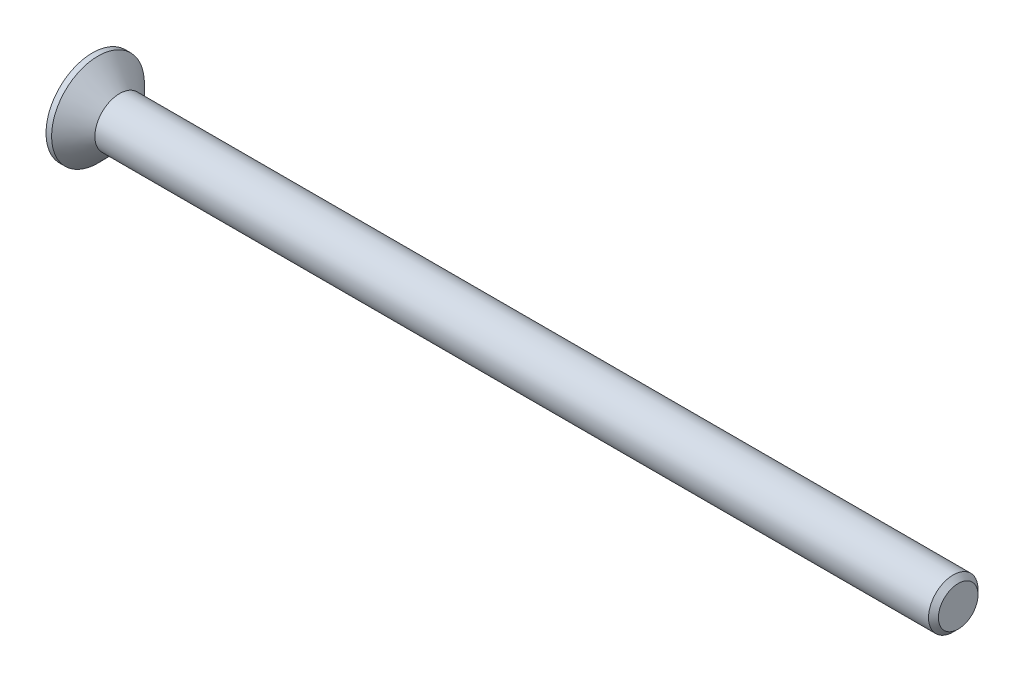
ISO-10303-21;
HEADER;
FILE_DESCRIPTION(('STEP AP214'),'2;1');
FILE_NAME('part.step','',(''),(''),'','','');
FILE_SCHEMA(('AUTOMOTIVE_DESIGN { 1 0 10303 214 1 1 1 1 }'));
ENDSEC;
DATA;
#1=APPLICATION_CONTEXT('core data for automotive mechanical design processes');
#2=APPLICATION_PROTOCOL_DEFINITION('international standard','automotive_design',2000,#1);
#3=PRODUCT_CONTEXT('',#1,'mechanical');
#4=PRODUCT('Part','Part','',(#3));
#5=PRODUCT_RELATED_PRODUCT_CATEGORY('part','',(#4));
#6=PRODUCT_DEFINITION_FORMATION('','',#4);
#7=PRODUCT_DEFINITION_CONTEXT('part definition',#1,'design');
#8=PRODUCT_DEFINITION('design','',#6,#7);
#9=PRODUCT_DEFINITION_SHAPE('','',#8);
#10=(LENGTH_UNIT() NAMED_UNIT(*) SI_UNIT(.MILLI.,.METRE.));
#11=(NAMED_UNIT(*) PLANE_ANGLE_UNIT() SI_UNIT($,.RADIAN.));
#12=(NAMED_UNIT(*) SI_UNIT($,.STERADIAN.) SOLID_ANGLE_UNIT());
#13=UNCERTAINTY_MEASURE_WITH_UNIT(LENGTH_MEASURE(1.E-05),#10,'distance_accuracy_value','');
#14=(GEOMETRIC_REPRESENTATION_CONTEXT(3) GLOBAL_UNCERTAINTY_ASSIGNED_CONTEXT((#13)) GLOBAL_UNIT_ASSIGNED_CONTEXT((#10,
#11,#12)) REPRESENTATION_CONTEXT('',''));
#15=CARTESIAN_POINT('',(0.,0.,0.));
#16=DIRECTION('',(0.,0.,1.));
#17=DIRECTION('',(1.,0.,0.));
#18=AXIS2_PLACEMENT_3D('',#15,#16,#17);
#19=CARTESIAN_POINT('',(0.,0.,0.));
#20=DIRECTION('',(-1.,0.,0.));
#21=DIRECTION('',(0.,0.,1.));
#22=AXIS2_PLACEMENT_3D('',#19,#20,#21);
#23=CONICAL_SURFACE('',#22,2.,0.78539816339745);
#24=CARTESIAN_POINT('',(-1.74999999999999,0.,0.));
#25=DIRECTION('',(-1.,0.,0.));
#26=DIRECTION('',(0.,0.,1.));
#27=AXIS2_PLACEMENT_3D('',#24,#25,#26);
#28=CIRCLE('',#27,3.75);
#29=CARTESIAN_POINT('',(-1.74999999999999,0.,3.75));
#30=VERTEX_POINT('',#29);
#31=EDGE_CURVE('E189',#30,#30,#28,.T.);
#32=ORIENTED_EDGE('',*,*,#31,.F.);
#33=EDGE_LOOP('',(#32));
#34=FACE_BOUND('',#33,.T.);
#35=CARTESIAN_POINT('',(0.,0.,0.));
#36=DIRECTION('',(-1.,0.,0.));
#37=DIRECTION('',(0.,0.,1.));
#38=AXIS2_PLACEMENT_3D('',#35,#36,#37);
#39=CIRCLE('',#38,2.);
#40=CARTESIAN_POINT('',(0.,0.,2.));
#41=VERTEX_POINT('',#40);
#42=EDGE_CURVE('E212',#41,#41,#39,.T.);
#43=ORIENTED_EDGE('',*,*,#42,.T.);
#44=EDGE_LOOP('',(#43));
#45=FACE_BOUND('',#44,.T.);
#46=ADVANCED_FACE('F33',(#34,#45),#23,.T.);
#47=CARTESIAN_POINT('',(-2.2,0.,0.));
#48=DIRECTION('',(-1.,0.,0.));
#49=DIRECTION('',(0.,0.,1.));
#50=AXIS2_PLACEMENT_3D('',#47,#48,#49);
#51=CYLINDRICAL_SURFACE('',#50,2.);
#52=CARTESIAN_POINT('',(67.4,0.,0.));
#53=DIRECTION('',(-1.,0.,0.));
#54=DIRECTION('',(0.,0.,1.));
#55=AXIS2_PLACEMENT_3D('',#52,#53,#54);
#56=CIRCLE('',#55,2.);
#57=CARTESIAN_POINT('',(67.4,0.,2.));
#58=VERTEX_POINT('',#57);
#59=EDGE_CURVE('E41',#58,#58,#56,.T.);
#60=ORIENTED_EDGE('',*,*,#59,.T.);
#61=EDGE_LOOP('',(#60));
#62=FACE_BOUND('',#61,.T.);
#63=ORIENTED_EDGE('',*,*,#42,.F.);
#64=EDGE_LOOP('',(#63));
#65=FACE_BOUND('',#64,.T.);
#66=ADVANCED_FACE('F217',(#62,#65),#51,.T.);
#67=CARTESIAN_POINT('',(67.8,0.,0.));
#68=DIRECTION('',(-1.,0.,0.));
#69=DIRECTION('',(0.,0.,1.));
#70=AXIS2_PLACEMENT_3D('',#67,#68,#69);
#71=PLANE('',#70);
#72=CARTESIAN_POINT('',(67.8,0.,0.));
#73=DIRECTION('',(-1.,0.,0.));
#74=DIRECTION('',(0.,0.,1.));
#75=AXIS2_PLACEMENT_3D('',#72,#73,#74);
#76=CIRCLE('',#75,1.59999999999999);
#77=CARTESIAN_POINT('',(67.8,0.,1.59999999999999));
#78=VERTEX_POINT('',#77);
#79=EDGE_CURVE('E11',#78,#78,#76,.F.);
#80=ORIENTED_EDGE('',*,*,#79,.T.);
#81=EDGE_LOOP('',(#80));
#82=FACE_BOUND('',#81,.T.);
#83=ADVANCED_FACE('F239',(#82),#71,.F.);
#84=CARTESIAN_POINT('',(-2.2,3.75,0.));
#85=DIRECTION('',(1.,0.,0.));
#86=DIRECTION('',(0.,0.,-1.));
#87=AXIS2_PLACEMENT_3D('',#84,#85,#86);
#88=PLANE('',#87);
#89=DIRECTION('',(0.,0.,-1.));
#90=VECTOR('',#89,1.);
#91=CARTESIAN_POINT('',(-2.2,0.55,-2.2));
#92=LINE('',#91,#90);
#93=CARTESIAN_POINT('',(-2.2,0.55,-0.55));
#94=VERTEX_POINT('',#93);
#95=CARTESIAN_POINT('',(-2.2,0.55,-2.2));
#96=VERTEX_POINT('',#95);
#97=EDGE_CURVE('E158',#94,#96,#92,.T.);
#98=ORIENTED_EDGE('',*,*,#97,.F.);
#99=DIRECTION('',(0.,-1.,0.));
#100=VECTOR('',#99,1.);
#101=CARTESIAN_POINT('',(-2.2,0.55,-0.55));
#102=LINE('',#101,#100);
#103=CARTESIAN_POINT('',(-2.2,2.2,-0.55));
#104=VERTEX_POINT('',#103);
#105=EDGE_CURVE('E48',#104,#94,#102,.T.);
#106=ORIENTED_EDGE('',*,*,#105,.F.);
#107=DIRECTION('',(0.,0.,-1.));
#108=VECTOR('',#107,1.);
#109=CARTESIAN_POINT('',(-2.2,2.2,-0.55));
#110=LINE('',#109,#108);
#111=CARTESIAN_POINT('',(-2.2,2.2,0.55));
#112=VERTEX_POINT('',#111);
#113=EDGE_CURVE('E185',#112,#104,#110,.T.);
#114=ORIENTED_EDGE('',*,*,#113,.F.);
#115=DIRECTION('',(0.,1.,0.));
#116=VECTOR('',#115,1.);
#117=CARTESIAN_POINT('',(-2.2,2.2,0.55));
#118=LINE('',#117,#116);
#119=CARTESIAN_POINT('',(-2.2,0.55,0.55));
#120=VERTEX_POINT('',#119);
#121=EDGE_CURVE('E183',#120,#112,#118,.T.);
#122=ORIENTED_EDGE('',*,*,#121,.F.);
#123=DIRECTION('',(0.,0.,-1.));
#124=VECTOR('',#123,1.);
#125=CARTESIAN_POINT('',(-2.2,0.55,0.55));
#126=LINE('',#125,#124);
#127=CARTESIAN_POINT('',(-2.2,0.55,2.2));
#128=VERTEX_POINT('',#127);
#129=EDGE_CURVE('E132',#128,#120,#126,.T.);
#130=ORIENTED_EDGE('',*,*,#129,.F.);
#131=DIRECTION('',(0.,1.,0.));
#132=VECTOR('',#131,1.);
#133=CARTESIAN_POINT('',(-2.2,0.55,2.2));
#134=LINE('',#133,#132);
#135=CARTESIAN_POINT('',(-2.2,-0.55,2.2));
#136=VERTEX_POINT('',#135);
#137=EDGE_CURVE('E179',#136,#128,#134,.T.);
#138=ORIENTED_EDGE('',*,*,#137,.F.);
#139=DIRECTION('',(0.,0.,1.));
#140=VECTOR('',#139,1.);
#141=CARTESIAN_POINT('',(-2.2,-0.55,2.2));
#142=LINE('',#141,#140);
#143=CARTESIAN_POINT('',(-2.2,-0.55,0.55));
#144=VERTEX_POINT('',#143);
#145=EDGE_CURVE('E176',#144,#136,#142,.T.);
#146=ORIENTED_EDGE('',*,*,#145,.F.);
#147=DIRECTION('',(0.,1.,0.));
#148=VECTOR('',#147,1.);
#149=CARTESIAN_POINT('',(-2.2,-0.55,0.55));
#150=LINE('',#149,#148);
#151=CARTESIAN_POINT('',(-2.2,-2.2,0.55));
#152=VERTEX_POINT('',#151);
#153=EDGE_CURVE('E173',#152,#144,#150,.T.);
#154=ORIENTED_EDGE('',*,*,#153,.F.);
#155=DIRECTION('',(0.,0.,1.));
#156=VECTOR('',#155,1.);
#157=CARTESIAN_POINT('',(-2.2,-2.2,0.55));
#158=LINE('',#157,#156);
#159=CARTESIAN_POINT('',(-2.2,-2.2,-0.55));
#160=VERTEX_POINT('',#159);
#161=EDGE_CURVE('E170',#160,#152,#158,.T.);
#162=ORIENTED_EDGE('',*,*,#161,.F.);
#163=DIRECTION('',(0.,-1.,0.));
#164=VECTOR('',#163,1.);
#165=CARTESIAN_POINT('',(-2.2,-2.2,-0.55));
#166=LINE('',#165,#164);
#167=CARTESIAN_POINT('',(-2.2,-0.55,-0.55));
#168=VERTEX_POINT('',#167);
#169=EDGE_CURVE('E167',#168,#160,#166,.T.);
#170=ORIENTED_EDGE('',*,*,#169,.F.);
#171=DIRECTION('',(0.,0.,1.));
#172=VECTOR('',#171,1.);
#173=CARTESIAN_POINT('',(-2.2,-0.55,-0.55));
#174=LINE('',#173,#172);
#175=CARTESIAN_POINT('',(-2.2,-0.55,-2.2));
#176=VERTEX_POINT('',#175);
#177=EDGE_CURVE('E164',#176,#168,#174,.T.);
#178=ORIENTED_EDGE('',*,*,#177,.F.);
#179=DIRECTION('',(0.,-1.,0.));
#180=VECTOR('',#179,1.);
#181=CARTESIAN_POINT('',(-2.2,-0.55,-2.2));
#182=LINE('',#181,#180);
#183=EDGE_CURVE('E161',#96,#176,#182,.T.);
#184=ORIENTED_EDGE('',*,*,#183,.F.);
#185=EDGE_LOOP('',(#98,#106,#114,#122,#130,#138,#146,#154,#162,#170,#178,#184));
#186=FACE_BOUND('',#185,.T.);
#187=CARTESIAN_POINT('',(-2.2,0.,0.));
#188=DIRECTION('',(-1.,0.,0.));
#189=DIRECTION('',(0.,0.,1.));
#190=AXIS2_PLACEMENT_3D('',#187,#188,#189);
#191=CIRCLE('',#190,3.75);
#192=CARTESIAN_POINT('',(-2.2,0.,3.75));
#193=VERTEX_POINT('',#192);
#194=EDGE_CURVE('E209',#193,#193,#191,.T.);
#195=ORIENTED_EDGE('',*,*,#194,.T.);
#196=EDGE_LOOP('',(#195));
#197=FACE_BOUND('',#196,.T.);
#198=ADVANCED_FACE('F230',(#186,#197),#88,.F.);
#199=CARTESIAN_POINT('',(-2.2,0.,0.));
#200=DIRECTION('',(-1.,0.,0.));
#201=DIRECTION('',(0.,0.,1.));
#202=AXIS2_PLACEMENT_3D('',#199,#200,#201);
#203=CYLINDRICAL_SURFACE('',#202,3.75);
#204=ORIENTED_EDGE('',*,*,#194,.F.);
#205=EDGE_LOOP('',(#204));
#206=FACE_BOUND('',#205,.T.);
#207=ORIENTED_EDGE('',*,*,#31,.T.);
#208=EDGE_LOOP('',(#207));
#209=FACE_BOUND('',#208,.T.);
#210=ADVANCED_FACE('F222',(#206,#209),#203,.T.);
#211=CARTESIAN_POINT('',(67.4,0.,0.));
#212=DIRECTION('',(-1.,0.,0.));
#213=DIRECTION('',(0.,0.,1.));
#214=AXIS2_PLACEMENT_3D('',#211,#212,#213);
#215=CONICAL_SURFACE('',#214,2.,0.785398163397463);
#216=ORIENTED_EDGE('',*,*,#79,.F.);
#217=EDGE_LOOP('',(#216));
#218=FACE_BOUND('',#217,.T.);
#219=ORIENTED_EDGE('',*,*,#59,.F.);
#220=EDGE_LOOP('',(#219));
#221=FACE_BOUND('',#220,.T.);
#222=ADVANCED_FACE('F35',(#218,#221),#215,.T.);
#223=CARTESIAN_POINT('',(-0.3,0.55,-0.55));
#224=DIRECTION('',(0.,0.,-1.));
#225=DIRECTION('',(-1.,0.,0.));
#226=AXIS2_PLACEMENT_3D('',#223,#224,#225);
#227=PLANE('',#226);
#228=ORIENTED_EDGE('',*,*,#105,.T.);
#229=DIRECTION('',(-1.,0.,0.));
#230=VECTOR('',#229,1.);
#231=CARTESIAN_POINT('',(-0.3,0.55,-0.55));
#232=LINE('',#231,#230);
#233=CARTESIAN_POINT('',(-0.3,0.55,-0.55));
#234=VERTEX_POINT('',#233);
#235=EDGE_CURVE('E96',#234,#94,#232,.T.);
#236=ORIENTED_EDGE('',*,*,#235,.F.);
#237=DIRECTION('',(0.,-1.,0.));
#238=VECTOR('',#237,1.);
#239=CARTESIAN_POINT('',(-0.3,0.55,-0.55));
#240=LINE('',#239,#238);
#241=CARTESIAN_POINT('',(-0.3,2.2,-0.55));
#242=VERTEX_POINT('',#241);
#243=EDGE_CURVE('E187',#242,#234,#240,.T.);
#244=ORIENTED_EDGE('',*,*,#243,.F.);
#245=DIRECTION('',(-1.,0.,0.));
#246=VECTOR('',#245,1.);
#247=CARTESIAN_POINT('',(-0.3,2.2,-0.55));
#248=LINE('',#247,#246);
#249=EDGE_CURVE('E56',#242,#104,#248,.T.);
#250=ORIENTED_EDGE('',*,*,#249,.T.);
#251=EDGE_LOOP('',(#228,#236,#244,#250));
#252=FACE_BOUND('',#251,.T.);
#253=ADVANCED_FACE('F221',(#252),#227,.F.);
#254=CARTESIAN_POINT('',(-0.3,2.2,-0.55));
#255=DIRECTION('',(0.,1.,0.));
#256=DIRECTION('',(-1.,0.,0.));
#257=AXIS2_PLACEMENT_3D('',#254,#255,#256);
#258=PLANE('',#257);
#259=ORIENTED_EDGE('',*,*,#113,.T.);
#260=ORIENTED_EDGE('',*,*,#249,.F.);
#261=DIRECTION('',(0.,0.,-1.));
#262=VECTOR('',#261,1.);
#263=CARTESIAN_POINT('',(-0.3,2.2,-0.55));
#264=LINE('',#263,#262);
#265=CARTESIAN_POINT('',(-0.3,2.2,0.55));
#266=VERTEX_POINT('',#265);
#267=EDGE_CURVE('E144',#266,#242,#264,.T.);
#268=ORIENTED_EDGE('',*,*,#267,.F.);
#269=DIRECTION('',(-1.,0.,0.));
#270=VECTOR('',#269,1.);
#271=CARTESIAN_POINT('',(-0.3,2.2,0.55));
#272=LINE('',#271,#270);
#273=EDGE_CURVE('E136',#266,#112,#272,.T.);
#274=ORIENTED_EDGE('',*,*,#273,.T.);
#275=EDGE_LOOP('',(#259,#260,#268,#274));
#276=FACE_BOUND('',#275,.T.);
#277=ADVANCED_FACE('F228',(#276),#258,.F.);
#278=CARTESIAN_POINT('',(-0.3,2.2,0.55));
#279=DIRECTION('',(0.,0.,1.));
#280=DIRECTION('',(1.,0.,0.));
#281=AXIS2_PLACEMENT_3D('',#278,#279,#280);
#282=PLANE('',#281);
#283=ORIENTED_EDGE('',*,*,#121,.T.);
#284=ORIENTED_EDGE('',*,*,#273,.F.);
#285=DIRECTION('',(0.,1.,0.));
#286=VECTOR('',#285,1.);
#287=CARTESIAN_POINT('',(-0.3,2.2,0.55));
#288=LINE('',#287,#286);
#289=CARTESIAN_POINT('',(-0.3,0.55,0.55));
#290=VERTEX_POINT('',#289);
#291=EDGE_CURVE('E140',#290,#266,#288,.T.);
#292=ORIENTED_EDGE('',*,*,#291,.F.);
#293=DIRECTION('',(-1.,0.,0.));
#294=VECTOR('',#293,1.);
#295=CARTESIAN_POINT('',(-0.3,0.55,0.55));
#296=LINE('',#295,#294);
#297=EDGE_CURVE('E125',#290,#120,#296,.T.);
#298=ORIENTED_EDGE('',*,*,#297,.T.);
#299=EDGE_LOOP('',(#283,#284,#292,#298));
#300=FACE_BOUND('',#299,.T.);
#301=ADVANCED_FACE('F141',(#300),#282,.F.);
#302=CARTESIAN_POINT('',(-0.3,0.55,0.55));
#303=DIRECTION('',(0.,1.,0.));
#304=DIRECTION('',(-1.,0.,0.));
#305=AXIS2_PLACEMENT_3D('',#302,#303,#304);
#306=PLANE('',#305);
#307=ORIENTED_EDGE('',*,*,#129,.T.);
#308=ORIENTED_EDGE('',*,*,#297,.F.);
#309=DIRECTION('',(0.,0.,-1.));
#310=VECTOR('',#309,1.);
#311=CARTESIAN_POINT('',(-0.3,0.55,0.55));
#312=LINE('',#311,#310);
#313=CARTESIAN_POINT('',(-0.3,0.55,2.2));
#314=VERTEX_POINT('',#313);
#315=EDGE_CURVE('E129',#314,#290,#312,.T.);
#316=ORIENTED_EDGE('',*,*,#315,.F.);
#317=DIRECTION('',(-1.,0.,0.));
#318=VECTOR('',#317,1.);
#319=CARTESIAN_POINT('',(-0.3,0.55,2.2));
#320=LINE('',#319,#318);
#321=EDGE_CURVE('E137',#314,#128,#320,.T.);
#322=ORIENTED_EDGE('',*,*,#321,.T.);
#323=EDGE_LOOP('',(#307,#308,#316,#322));
#324=FACE_BOUND('',#323,.T.);
#325=ADVANCED_FACE('F127',(#324),#306,.F.);
#326=CARTESIAN_POINT('',(-0.3,0.55,2.2));
#327=DIRECTION('',(0.,0.,1.));
#328=DIRECTION('',(1.,0.,0.));
#329=AXIS2_PLACEMENT_3D('',#326,#327,#328);
#330=PLANE('',#329);
#331=ORIENTED_EDGE('',*,*,#137,.T.);
#332=ORIENTED_EDGE('',*,*,#321,.F.);
#333=DIRECTION('',(0.,1.,0.));
#334=VECTOR('',#333,1.);
#335=CARTESIAN_POINT('',(-0.3,0.55,2.2));
#336=LINE('',#335,#334);
#337=CARTESIAN_POINT('',(-0.3,-0.55,2.2));
#338=VERTEX_POINT('',#337);
#339=EDGE_CURVE('E150',#338,#314,#336,.T.);
#340=ORIENTED_EDGE('',*,*,#339,.F.);
#341=DIRECTION('',(-1.,0.,0.));
#342=VECTOR('',#341,1.);
#343=CARTESIAN_POINT('',(-0.3,-0.55,2.2));
#344=LINE('',#343,#342);
#345=EDGE_CURVE('E192',#338,#136,#344,.T.);
#346=ORIENTED_EDGE('',*,*,#345,.T.);
#347=EDGE_LOOP('',(#331,#332,#340,#346));
#348=FACE_BOUND('',#347,.T.);
#349=ADVANCED_FACE('F277',(#348),#330,.F.);
#350=CARTESIAN_POINT('',(-0.3,-0.55,2.2));
#351=DIRECTION('',(0.,-1.,0.));
#352=DIRECTION('',(1.,0.,0.));
#353=AXIS2_PLACEMENT_3D('',#350,#351,#352);
#354=PLANE('',#353);
#355=ORIENTED_EDGE('',*,*,#145,.T.);
#356=ORIENTED_EDGE('',*,*,#345,.F.);
#357=DIRECTION('',(0.,0.,1.));
#358=VECTOR('',#357,1.);
#359=CARTESIAN_POINT('',(-0.3,-0.55,2.2));
#360=LINE('',#359,#358);
#361=CARTESIAN_POINT('',(-0.3,-0.55,0.55));
#362=VERTEX_POINT('',#361);
#363=EDGE_CURVE('E152',#362,#338,#360,.T.);
#364=ORIENTED_EDGE('',*,*,#363,.F.);
#365=DIRECTION('',(-1.,0.,0.));
#366=VECTOR('',#365,1.);
#367=CARTESIAN_POINT('',(-0.3,-0.55,0.55));
#368=LINE('',#367,#366);
#369=EDGE_CURVE('E194',#362,#144,#368,.T.);
#370=ORIENTED_EDGE('',*,*,#369,.T.);
#371=EDGE_LOOP('',(#355,#356,#364,#370));
#372=FACE_BOUND('',#371,.T.);
#373=ADVANCED_FACE('F273',(#372),#354,.F.);
#374=CARTESIAN_POINT('',(-0.3,-0.55,0.55));
#375=DIRECTION('',(0.,0.,1.));
#376=DIRECTION('',(1.,0.,0.));
#377=AXIS2_PLACEMENT_3D('',#374,#375,#376);
#378=PLANE('',#377);
#379=ORIENTED_EDGE('',*,*,#153,.T.);
#380=ORIENTED_EDGE('',*,*,#369,.F.);
#381=DIRECTION('',(0.,1.,0.));
#382=VECTOR('',#381,1.);
#383=CARTESIAN_POINT('',(-0.3,-0.55,0.55));
#384=LINE('',#383,#382);
#385=CARTESIAN_POINT('',(-0.3,-2.2,0.55));
#386=VERTEX_POINT('',#385);
#387=EDGE_CURVE('E422',#386,#362,#384,.T.);
#388=ORIENTED_EDGE('',*,*,#387,.F.);
#389=DIRECTION('',(-1.,0.,0.));
#390=VECTOR('',#389,1.);
#391=CARTESIAN_POINT('',(-0.3,-2.2,0.55));
#392=LINE('',#391,#390);
#393=EDGE_CURVE('E196',#386,#152,#392,.T.);
#394=ORIENTED_EDGE('',*,*,#393,.T.);
#395=EDGE_LOOP('',(#379,#380,#388,#394));
#396=FACE_BOUND('',#395,.T.);
#397=ADVANCED_FACE('F269',(#396),#378,.F.);
#398=CARTESIAN_POINT('',(-0.3,-2.2,0.55));
#399=DIRECTION('',(0.,-1.,0.));
#400=DIRECTION('',(1.,0.,0.));
#401=AXIS2_PLACEMENT_3D('',#398,#399,#400);
#402=PLANE('',#401);
#403=ORIENTED_EDGE('',*,*,#161,.T.);
#404=ORIENTED_EDGE('',*,*,#393,.F.);
#405=DIRECTION('',(0.,0.,1.));
#406=VECTOR('',#405,1.);
#407=CARTESIAN_POINT('',(-0.3,-2.2,0.55));
#408=LINE('',#407,#406);
#409=CARTESIAN_POINT('',(-0.3,-2.2,-0.55));
#410=VERTEX_POINT('',#409);
#411=EDGE_CURVE('E419',#410,#386,#408,.T.);
#412=ORIENTED_EDGE('',*,*,#411,.F.);
#413=DIRECTION('',(-1.,0.,0.));
#414=VECTOR('',#413,1.);
#415=CARTESIAN_POINT('',(-0.3,-2.2,-0.55));
#416=LINE('',#415,#414);
#417=EDGE_CURVE('E198',#410,#160,#416,.T.);
#418=ORIENTED_EDGE('',*,*,#417,.T.);
#419=EDGE_LOOP('',(#403,#404,#412,#418));
#420=FACE_BOUND('',#419,.T.);
#421=ADVANCED_FACE('F265',(#420),#402,.F.);
#422=CARTESIAN_POINT('',(-0.3,-2.2,-0.55));
#423=DIRECTION('',(0.,0.,-1.));
#424=DIRECTION('',(-1.,0.,0.));
#425=AXIS2_PLACEMENT_3D('',#422,#423,#424);
#426=PLANE('',#425);
#427=ORIENTED_EDGE('',*,*,#169,.T.);
#428=ORIENTED_EDGE('',*,*,#417,.F.);
#429=DIRECTION('',(0.,-1.,0.));
#430=VECTOR('',#429,1.);
#431=CARTESIAN_POINT('',(-0.3,-2.2,-0.55));
#432=LINE('',#431,#430);
#433=CARTESIAN_POINT('',(-0.3,-0.55,-0.55));
#434=VERTEX_POINT('',#433);
#435=EDGE_CURVE('E416',#434,#410,#432,.T.);
#436=ORIENTED_EDGE('',*,*,#435,.F.);
#437=DIRECTION('',(-1.,0.,0.));
#438=VECTOR('',#437,1.);
#439=CARTESIAN_POINT('',(-0.3,-0.55,-0.55));
#440=LINE('',#439,#438);
#441=EDGE_CURVE('E200',#434,#168,#440,.T.);
#442=ORIENTED_EDGE('',*,*,#441,.T.);
#443=EDGE_LOOP('',(#427,#428,#436,#442));
#444=FACE_BOUND('',#443,.T.);
#445=ADVANCED_FACE('F261',(#444),#426,.F.);
#446=CARTESIAN_POINT('',(-0.3,-0.55,-0.55));
#447=DIRECTION('',(0.,-1.,0.));
#448=DIRECTION('',(1.,0.,0.));
#449=AXIS2_PLACEMENT_3D('',#446,#447,#448);
#450=PLANE('',#449);
#451=ORIENTED_EDGE('',*,*,#177,.T.);
#452=ORIENTED_EDGE('',*,*,#441,.F.);
#453=DIRECTION('',(0.,0.,1.));
#454=VECTOR('',#453,1.);
#455=CARTESIAN_POINT('',(-0.3,-0.55,-0.55));
#456=LINE('',#455,#454);
#457=CARTESIAN_POINT('',(-0.3,-0.55,-2.2));
#458=VERTEX_POINT('',#457);
#459=EDGE_CURVE('E413',#458,#434,#456,.T.);
#460=ORIENTED_EDGE('',*,*,#459,.F.);
#461=DIRECTION('',(-1.,0.,0.));
#462=VECTOR('',#461,1.);
#463=CARTESIAN_POINT('',(-0.3,-0.55,-2.2));
#464=LINE('',#463,#462);
#465=EDGE_CURVE('E202',#458,#176,#464,.T.);
#466=ORIENTED_EDGE('',*,*,#465,.T.);
#467=EDGE_LOOP('',(#451,#452,#460,#466));
#468=FACE_BOUND('',#467,.T.);
#469=ADVANCED_FACE('F257',(#468),#450,.F.);
#470=CARTESIAN_POINT('',(-0.3,-0.55,-2.2));
#471=DIRECTION('',(0.,0.,-1.));
#472=DIRECTION('',(-1.,0.,0.));
#473=AXIS2_PLACEMENT_3D('',#470,#471,#472);
#474=PLANE('',#473);
#475=ORIENTED_EDGE('',*,*,#183,.T.);
#476=ORIENTED_EDGE('',*,*,#465,.F.);
#477=DIRECTION('',(0.,-1.,0.));
#478=VECTOR('',#477,1.);
#479=CARTESIAN_POINT('',(-0.3,-0.55,-2.2));
#480=LINE('',#479,#478);
#481=CARTESIAN_POINT('',(-0.3,0.55,-2.2));
#482=VERTEX_POINT('',#481);
#483=EDGE_CURVE('E408',#482,#458,#480,.T.);
#484=ORIENTED_EDGE('',*,*,#483,.F.);
#485=DIRECTION('',(-1.,0.,0.));
#486=VECTOR('',#485,1.);
#487=CARTESIAN_POINT('',(-0.3,0.55,-2.2));
#488=LINE('',#487,#486);
#489=EDGE_CURVE('E204',#482,#96,#488,.T.);
#490=ORIENTED_EDGE('',*,*,#489,.T.);
#491=EDGE_LOOP('',(#475,#476,#484,#490));
#492=FACE_BOUND('',#491,.T.);
#493=ADVANCED_FACE('F253',(#492),#474,.F.);
#494=CARTESIAN_POINT('',(-0.3,0.55,-2.2));
#495=DIRECTION('',(0.,1.,0.));
#496=DIRECTION('',(-1.,0.,0.));
#497=AXIS2_PLACEMENT_3D('',#494,#495,#496);
#498=PLANE('',#497);
#499=ORIENTED_EDGE('',*,*,#97,.T.);
#500=ORIENTED_EDGE('',*,*,#489,.F.);
#501=DIRECTION('',(0.,0.,-1.));
#502=VECTOR('',#501,1.);
#503=CARTESIAN_POINT('',(-0.3,0.55,-2.2));
#504=LINE('',#503,#502);
#505=EDGE_CURVE('E406',#234,#482,#504,.T.);
#506=ORIENTED_EDGE('',*,*,#505,.F.);
#507=ORIENTED_EDGE('',*,*,#235,.T.);
#508=EDGE_LOOP('',(#499,#500,#506,#507));
#509=FACE_BOUND('',#508,.T.);
#510=ADVANCED_FACE('F250',(#509),#498,.F.);
#511=CARTESIAN_POINT('',(-0.3,0.,0.));
#512=DIRECTION('',(1.,0.,0.));
#513=DIRECTION('',(0.,0.,-1.));
#514=AXIS2_PLACEMENT_3D('',#511,#512,#513);
#515=PLANE('',#514);
#516=ORIENTED_EDGE('',*,*,#243,.T.);
#517=ORIENTED_EDGE('',*,*,#505,.T.);
#518=ORIENTED_EDGE('',*,*,#483,.T.);
#519=ORIENTED_EDGE('',*,*,#459,.T.);
#520=ORIENTED_EDGE('',*,*,#435,.T.);
#521=ORIENTED_EDGE('',*,*,#411,.T.);
#522=ORIENTED_EDGE('',*,*,#387,.T.);
#523=ORIENTED_EDGE('',*,*,#363,.T.);
#524=ORIENTED_EDGE('',*,*,#339,.T.);
#525=ORIENTED_EDGE('',*,*,#315,.T.);
#526=ORIENTED_EDGE('',*,*,#291,.T.);
#527=ORIENTED_EDGE('',*,*,#267,.T.);
#528=EDGE_LOOP('',(#516,#517,#518,#519,#520,#521,#522,#523,#524,#525,#526,#527));
#529=FACE_BOUND('',#528,.T.);
#530=ADVANCED_FACE('F147',(#529),#515,.F.);
#531=CLOSED_SHELL('',(#46,#66,#83,#198,#210,#222,#253,#277,#301,#325,#349,#373,#397,#421,#445,
#469,#493,#510,#530));
#532=MANIFOLD_SOLID_BREP('B2',#531);
#533=ADVANCED_BREP_SHAPE_REPRESENTATION('',(#18,#532),#14);
#534=SHAPE_DEFINITION_REPRESENTATION(#9,#533);
ENDSEC;
END-ISO-10303-21;
